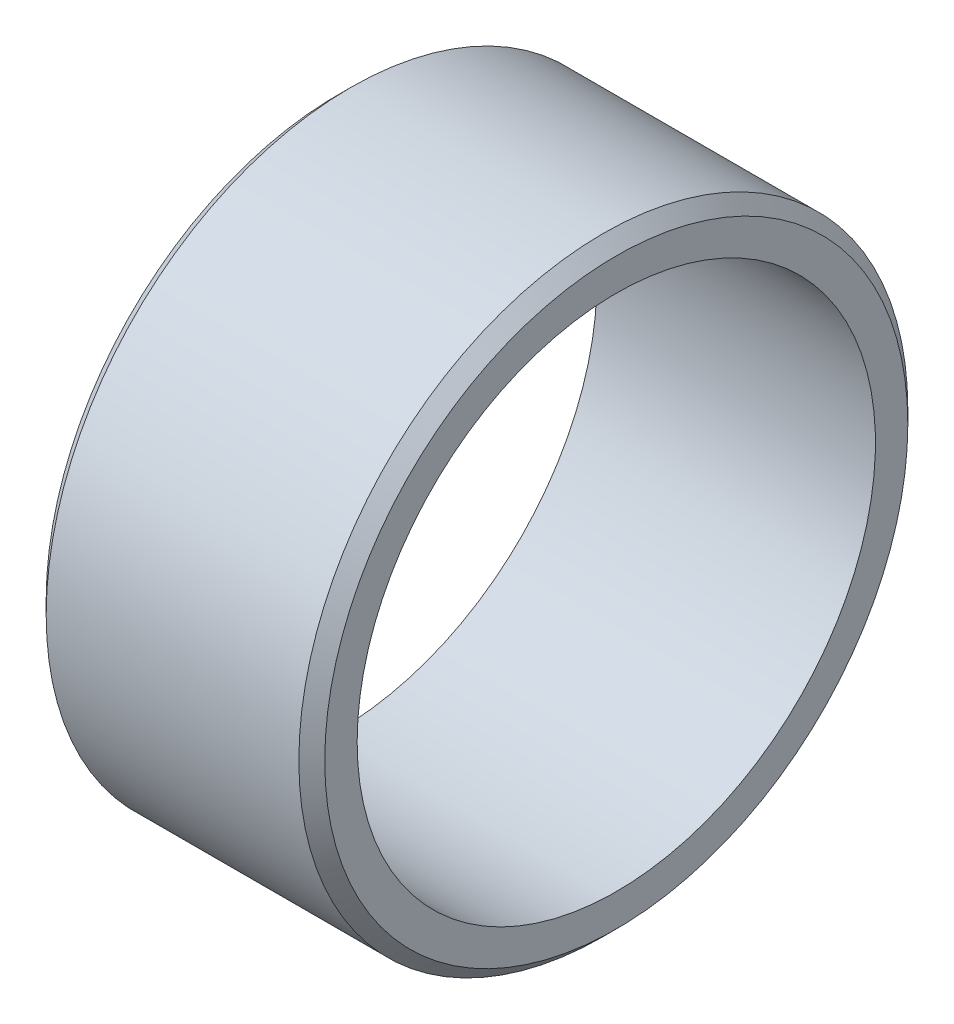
ISO-10303-21;
HEADER;
FILE_DESCRIPTION(('STEP AP214'),'2;1');
FILE_NAME('part.step','',(''),(''),'','','');
FILE_SCHEMA(('AUTOMOTIVE_DESIGN { 1 0 10303 214 1 1 1 1 }'));
ENDSEC;
DATA;
#1=APPLICATION_CONTEXT('core data for automotive mechanical design processes');
#2=APPLICATION_PROTOCOL_DEFINITION('international standard','automotive_design',2000,#1);
#3=PRODUCT_CONTEXT('',#1,'mechanical');
#4=PRODUCT('Part','Part','',(#3));
#5=PRODUCT_RELATED_PRODUCT_CATEGORY('part','',(#4));
#6=PRODUCT_DEFINITION_FORMATION('','',#4);
#7=PRODUCT_DEFINITION_CONTEXT('part definition',#1,'design');
#8=PRODUCT_DEFINITION('design','',#6,#7);
#9=PRODUCT_DEFINITION_SHAPE('','',#8);
#10=(LENGTH_UNIT() NAMED_UNIT(*) SI_UNIT(.MILLI.,.METRE.));
#11=(NAMED_UNIT(*) PLANE_ANGLE_UNIT() SI_UNIT($,.RADIAN.));
#12=(NAMED_UNIT(*) SI_UNIT($,.STERADIAN.) SOLID_ANGLE_UNIT());
#13=UNCERTAINTY_MEASURE_WITH_UNIT(LENGTH_MEASURE(1.E-05),#10,'distance_accuracy_value','');
#14=(GEOMETRIC_REPRESENTATION_CONTEXT(3) GLOBAL_UNCERTAINTY_ASSIGNED_CONTEXT((#13)) GLOBAL_UNIT_ASSIGNED_CONTEXT((#10,
#11,#12)) REPRESENTATION_CONTEXT('',''));
#15=CARTESIAN_POINT('',(0.,0.,0.));
#16=DIRECTION('',(0.,0.,1.));
#17=DIRECTION('',(1.,0.,0.));
#18=AXIS2_PLACEMENT_3D('',#15,#16,#17);
#19=CARTESIAN_POINT('',(0.,22.5,0.));
#20=DIRECTION('',(-1.,0.,0.));
#21=DIRECTION('',(0.,0.,1.));
#22=AXIS2_PLACEMENT_3D('',#19,#20,#21);
#23=PLANE('',#22);
#24=CARTESIAN_POINT('',(0.,0.,0.));
#25=DIRECTION('',(-1.,0.,0.));
#26=DIRECTION('',(0.,0.,1.));
#27=AXIS2_PLACEMENT_3D('',#24,#25,#26);
#28=CIRCLE('',#27,22.5);
#29=CARTESIAN_POINT('',(0.,0.,22.5));
#30=VERTEX_POINT('',#29);
#31=EDGE_CURVE('E10',#30,#30,#28,.T.);
#32=ORIENTED_EDGE('',*,*,#31,.F.);
#33=EDGE_LOOP('',(#32));
#34=FACE_BOUND('',#33,.T.);
#35=CARTESIAN_POINT('',(0.,0.,0.));
#36=DIRECTION('',(-1.,0.,0.));
#37=DIRECTION('',(0.,0.,1.));
#38=AXIS2_PLACEMENT_3D('',#35,#36,#37);
#39=CIRCLE('',#38,20.);
#40=CARTESIAN_POINT('',(0.,0.,20.));
#41=VERTEX_POINT('',#40);
#42=EDGE_CURVE('E53',#41,#41,#39,.T.);
#43=ORIENTED_EDGE('',*,*,#42,.T.);
#44=EDGE_LOOP('',(#43));
#45=FACE_BOUND('',#44,.T.);
#46=ADVANCED_FACE('F31',(#34,#45),#23,.F.);
#47=CARTESIAN_POINT('',(0.,0.,0.));
#48=DIRECTION('',(-1.,0.,0.));
#49=DIRECTION('',(0.,0.,1.));
#50=AXIS2_PLACEMENT_3D('',#47,#48,#49);
#51=CONICAL_SURFACE('',#50,22.5,0.785398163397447);
#52=CARTESIAN_POINT('',(-1.,0.,0.));
#53=DIRECTION('',(-1.,0.,0.));
#54=DIRECTION('',(0.,0.,1.));
#55=AXIS2_PLACEMENT_3D('',#52,#53,#54);
#56=CIRCLE('',#55,23.5);
#57=CARTESIAN_POINT('',(-1.,0.,23.5));
#58=VERTEX_POINT('',#57);
#59=EDGE_CURVE('E37',#58,#58,#56,.T.);
#60=ORIENTED_EDGE('',*,*,#59,.F.);
#61=EDGE_LOOP('',(#60));
#62=FACE_BOUND('',#61,.T.);
#63=ORIENTED_EDGE('',*,*,#31,.T.);
#64=EDGE_LOOP('',(#63));
#65=FACE_BOUND('',#64,.T.);
#66=ADVANCED_FACE('F78',(#62,#65),#51,.T.);
#67=CARTESIAN_POINT('',(-20.663939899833,0.,0.));
#68=DIRECTION('',(-1.,0.,0.));
#69=DIRECTION('',(0.,0.,1.));
#70=AXIS2_PLACEMENT_3D('',#67,#68,#69);
#71=CYLINDRICAL_SURFACE('',#70,23.5);
#72=CARTESIAN_POINT('',(-20.5,0.,0.));
#73=DIRECTION('',(-1.,0.,0.));
#74=DIRECTION('',(0.,0.,1.));
#75=AXIS2_PLACEMENT_3D('',#72,#73,#74);
#76=CIRCLE('',#75,23.5);
#77=CARTESIAN_POINT('',(-20.5,0.,23.5));
#78=VERTEX_POINT('',#77);
#79=EDGE_CURVE('E41',#78,#78,#76,.T.);
#80=ORIENTED_EDGE('',*,*,#79,.F.);
#81=EDGE_LOOP('',(#80));
#82=FACE_BOUND('',#81,.T.);
#83=ORIENTED_EDGE('',*,*,#59,.T.);
#84=EDGE_LOOP('',(#83));
#85=FACE_BOUND('',#84,.T.);
#86=ADVANCED_FACE('F73',(#82,#85),#71,.T.);
#87=CARTESIAN_POINT('',(-20.5,0.,0.));
#88=DIRECTION('',(1.,0.,0.));
#89=DIRECTION('',(0.,0.,-1.));
#90=AXIS2_PLACEMENT_3D('',#87,#88,#89);
#91=CONICAL_SURFACE('',#90,23.5,0.785398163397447);
#92=CARTESIAN_POINT('',(-21.5,0.,0.));
#93=DIRECTION('',(-1.,0.,0.));
#94=DIRECTION('',(0.,0.,1.));
#95=AXIS2_PLACEMENT_3D('',#92,#93,#94);
#96=CIRCLE('',#95,22.5);
#97=CARTESIAN_POINT('',(-21.5,0.,22.5));
#98=VERTEX_POINT('',#97);
#99=EDGE_CURVE('E45',#98,#98,#96,.T.);
#100=ORIENTED_EDGE('',*,*,#99,.F.);
#101=EDGE_LOOP('',(#100));
#102=FACE_BOUND('',#101,.T.);
#103=ORIENTED_EDGE('',*,*,#79,.T.);
#104=EDGE_LOOP('',(#103));
#105=FACE_BOUND('',#104,.T.);
#106=ADVANCED_FACE('F67',(#102,#105),#91,.T.);
#107=CARTESIAN_POINT('',(-21.5,22.5,0.));
#108=DIRECTION('',(1.,0.,0.));
#109=DIRECTION('',(0.,0.,-1.));
#110=AXIS2_PLACEMENT_3D('',#107,#108,#109);
#111=PLANE('',#110);
#112=CARTESIAN_POINT('',(-21.5,0.,0.));
#113=DIRECTION('',(-1.,0.,0.));
#114=DIRECTION('',(0.,0.,1.));
#115=AXIS2_PLACEMENT_3D('',#112,#113,#114);
#116=CIRCLE('',#115,20.);
#117=CARTESIAN_POINT('',(-21.5,0.,20.));
#118=VERTEX_POINT('',#117);
#119=EDGE_CURVE('E50',#118,#118,#116,.T.);
#120=ORIENTED_EDGE('',*,*,#119,.F.);
#121=EDGE_LOOP('',(#120));
#122=FACE_BOUND('',#121,.T.);
#123=ORIENTED_EDGE('',*,*,#99,.T.);
#124=EDGE_LOOP('',(#123));
#125=FACE_BOUND('',#124,.T.);
#126=ADVANCED_FACE('F61',(#122,#125),#111,.F.);
#127=CARTESIAN_POINT('',(-20.663939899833,0.,0.));
#128=DIRECTION('',(-1.,0.,0.));
#129=DIRECTION('',(0.,0.,1.));
#130=AXIS2_PLACEMENT_3D('',#127,#128,#129);
#131=CYLINDRICAL_SURFACE('',#130,20.);
#132=ORIENTED_EDGE('',*,*,#42,.F.);
#133=EDGE_LOOP('',(#132));
#134=FACE_BOUND('',#133,.T.);
#135=ORIENTED_EDGE('',*,*,#119,.T.);
#136=EDGE_LOOP('',(#135));
#137=FACE_BOUND('',#136,.T.);
#138=ADVANCED_FACE('F58',(#134,#137),#131,.F.);
#139=CLOSED_SHELL('',(#46,#66,#86,#106,#126,#138));
#140=MANIFOLD_SOLID_BREP('B2',#139);
#141=ADVANCED_BREP_SHAPE_REPRESENTATION('',(#18,#140),#14);
#142=SHAPE_DEFINITION_REPRESENTATION(#9,#141);
ENDSEC;
END-ISO-10303-21;
